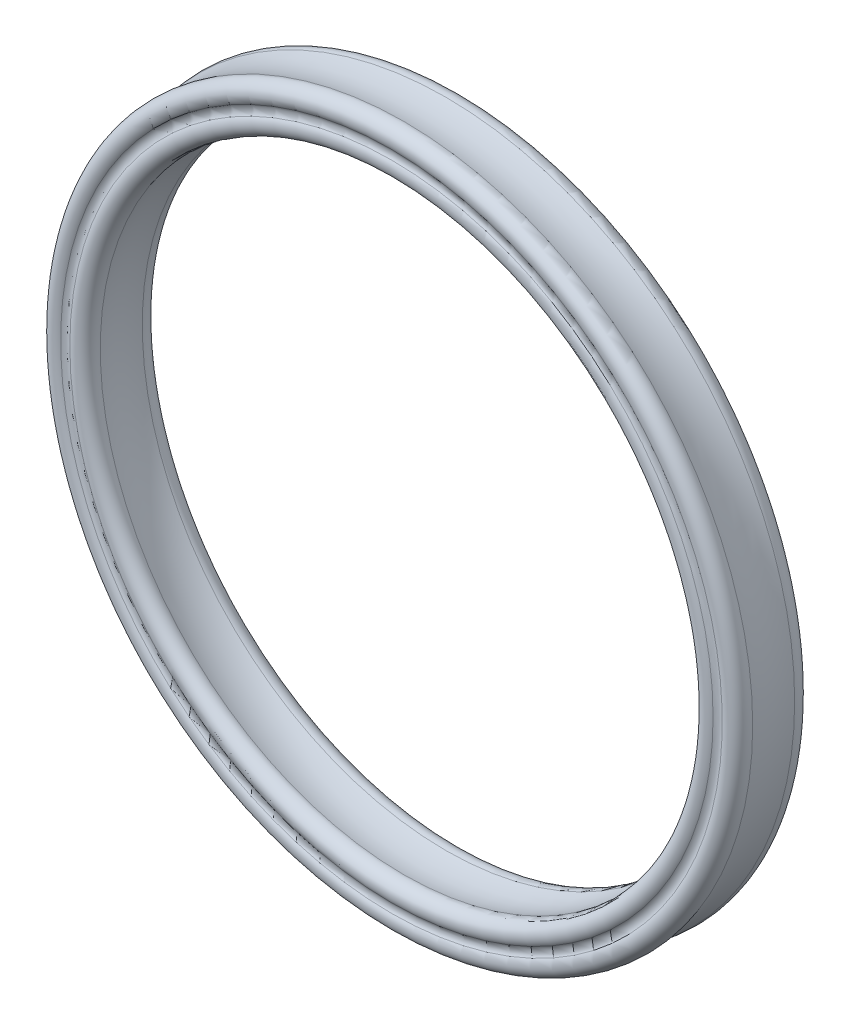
from build123d import *


with BuildPart() as part:
    # Esquisse1 → Base-R_volution (revolve)
    with BuildSketch(Plane(origin=(0, 0, 0), x_dir=(0, 0, -1), z_dir=(1, 0, 0)), mode=Mode.PRIVATE) as base_r_volution_sk:
        with BuildLine():
            ThreePointArc((0.80801105, 18.972605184), (0.113521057, 18.734185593), (0.125, 18))
            ThreePointArc((0.125, 18), (0.208333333, 17.75), (0.125, 17.5))
            ThreePointArc((0.125, 17.5), (0.113521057, 16.765814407), (0.80801105, 16.527394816))
            ThreePointArc((0.80801105, 16.527394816), (1.95, 16.698338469), (3.09198895, 16.527394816))
            ThreePointArc((3.09198895, 16.527394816), (3.786478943, 16.765814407), (3.775, 17.5))
            ThreePointArc((3.775, 17.5), (3.691666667, 17.75), (3.775, 18))
            ThreePointArc((3.775, 18), (3.786478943, 18.734185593), (3.09198895, 18.972605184))
            ThreePointArc((3.09198895, 18.972605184), (1.95, 18.801661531), (0.80801105, 18.972605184))
        make_face()
    revolve(base_r_volution_sk.sketch.rotate(Axis((0, 0, 0), (0, 0, -1)), 180), axis=Axis((0, 0, 0), (0, 0, -1)))


solid = part.part
